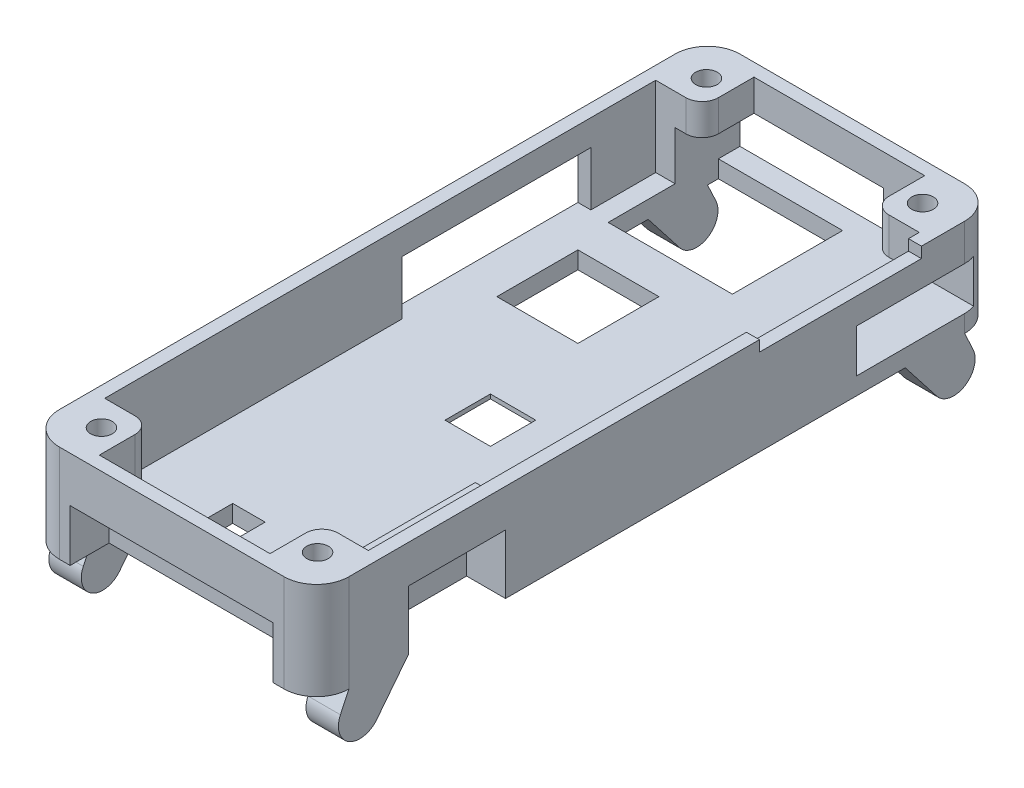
from build123d import *

# Parameters (mm, degrees)
SKETCH_1_W                = 26.8
SKETCH_1_H                = 63
EXTRUDE_1_DEPTH           = 9
FILLET_1_R                = 3
SHELL_1_T                 = -1.2
SHELL_1_THICKNESS_2_DEPTH = 0.4
EXTRUDE_START             = 7.4
EXTRUDE_2_DEPTH           = 7.4
MIRROR_START              = 7.4
MIRROR_2_COPY_1_DEPTH     = 7.4
SKETCH_4_W                = 18.8
SKETCH_4_H                = 3.6
CUT_EXTRUDE_1_DEPTH       = 4.8
SKETCH_5_W                = 3
SKETCH_5_H                = 4.5
SKETCH_5_W_2              = 4.2
SKETCH_5_H_2              = 4.2
CUT_EXTRUDE_2_DEPTH       = 36.02242139
SKETCH_7_W                = 11.5
SKETCH_7_H                = 11
SKETCH_7_W_2              = 7.5
SKETCH_7_H_2              = 7.5
CUT_EXTRUDE_3_DEPTH       = 1.6
SKETCH_8_W                = 4
SKETCH_8_H                = 9
CUT_EXTRUDE_4_DEPTH       = 5.5
EXTRUDE_4_DEPTH           = 3
MIRROR_4_COPY_1_DEPTH     = 3
SKETCH_10_W               = 9
SKETCH_10_H               = 1.2
EXTRUDE_5_DEPTH           = 2.8
CUT_EXTRUDE_7_REACH       = 38.798
SKETCH_11_W               = 1
SKETCH_11_H               = 6
SKETCH_12_W               = 2.8
SKETCH_12_H               = 5.1
EXTRUDE_6_DEPTH           = 1.2
SKETCH_13_W               = 2.8
SKETCH_13_H               = 5.1
EXTRUDE_7_DEPTH           = 1.2
SKETCH_14_W               = 1.5
SKETCH_14_H               = 3.8
EXTRUDE_11_DEPTH          = 4.2
EXTRUDE_12_DEPTH          = 1
MIRROR_9_COPY_1_DEPTH     = 1
SKETCH_3_R                = 1
CUT_EXTRUDE_8_DEPTH       = 4
MIRROR_11_COPY_1_SKETCH_R = 1
MIRROR_11_COPY_1_DEPTH    = 4
FILLET_2_R                = 1.5
CUT_EXTRUDE_9_REACH       = 44.326
SKETCH_18_W               = 11
SKETCH_18_H               = 4
CUT_EXTRUDE_START         = -4.8
SKETCH_19_W               = 10.5
SKETCH_19_H               = 1.2
CUT_EXTRUDE_10_DEPTH      = 4.8
SKETCH_20_W               = 0.4
SKETCH_20_H               = 9
EXTRUDE_13_DEPTH          = 5.5
SKETCH_21_W               = 14.5
SKETCH_21_H               = 4.5
CUT_EXTRUDE_12_DEPTH      = 10
SKETCH_23_R               = 10.3
CUT_EXTRUDE_15_DEPTH      = 1.2
SKETCH_24_W               = 11.5
SKETCH_24_H               = 2
EXTRUDE_14_DEPTH          = 1.6
SKETCH_25_W               = 1.2
SKETCH_25_H               = 15
CUT_EXTRUDE_16_DEPTH      = 1
SKETCH_26_W               = 17.5
SKETCH_26_H               = 5
CUT_EXTRUDE_17_DEPTH      = 1.2


with BuildPart() as part:
    # Sketch 1 → Extrude 1 (new body)
    with BuildSketch(Plane(origin=(0, 0, 0), x_dir=(1, 0, 0), z_dir=(0, 1, 0))):
        Rectangle(SKETCH_1_W, SKETCH_1_H)
    extrude(amount=EXTRUDE_1_DEPTH)

    # Fillet 1
    fillet_1_edges = [part.edges().sort_by_distance(p)[0] for p in [
        (13.4, 4.5, 31.5),
        (-13.4, 4.5, 31.5),
        (-13.4, 4.5, -31.5),
        (13.4, 4.5, -31.5),
    ]]
    fillet(fillet_1_edges, radius=FILLET_1_R)

    # Shell 1
    shell_1_openings = [part.faces().sort_by_distance(p)[0] for p in [
        (0, 9, 0),
    ]]
    offset(amount=SHELL_1_T, openings=shell_1_openings, kind=Kind.INTERSECTION)

    # Shell 1 thickness 2 face (on inner face of the shell) → Shell 1 thickness 2 (add)
    with BuildSketch(Plane(origin=(0, 1.2, 0), x_dir=(0, 0, -1), z_dir=(0, -1, 0))):
        with BuildLine():
            ThreePointArc((30.3, -10.4), (29.772792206, -11.672792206), (28.5, -12.2))
            Line((28.5, -12.2), (-28.5, -12.2))
            ThreePointArc((-28.5, -12.2), (-29.772792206, -11.672792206), (-30.3, -10.4))
            Line((-30.3, -10.4), (-30.3, 10.4))
            ThreePointArc((-30.3, 10.4), (-29.772792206, 11.672792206), (-28.5, 12.2))
            Line((-28.5, 12.2), (28.5, 12.2))
            ThreePointArc((28.5, 12.2), (29.772792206, 11.672792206), (30.3, 10.4))
            Line((30.3, 10.4), (30.3, -10.4))
        make_face()
    extrude(amount=-SHELL_1_THICKNESS_2_DEPTH)

    # Sketch 2 → Extrude 2 (add)
    with BuildSketch(Plane(origin=(0, 1.6, 0), x_dir=(1, 0, 0), z_dir=(0, 1, 0)).offset(EXTRUDE_START)):
        with BuildLine():
            Line((10, -26.5), (9.4, -26.5))
            Line((9.4, -26.5), (9.4, -26.625227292))
            Line((9.4, -26.625227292), (9.4, -30.3))
            Line((9.4, -30.3), (10.4, -30.3))
            ThreePointArc((10.4, -30.3), (11.672792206, -29.772792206), (12.2, -28.5))
            Line((12.2, -28.5), (12.2, -26.5))
            Line((12.2, -26.5), (10, -26.5))
        make_face()
    extrude_2 = extrude(amount=-EXTRUDE_2_DEPTH)

    # Mirror 1: Extrude 2 across plane
    add(extrude_2.mirror(Plane(origin=(0, 0, 0), x_dir=(0, 0, 1), z_dir=(1, 0, 0))))

    # Mirror 2: Extrude 2 across plane
    add(extrude_2.mirror(Plane.XY))

    # Mirror 2 copy 1 sketch → Mirror 2 copy 1 (add)
    with BuildSketch(Plane(origin=(0, 1.6, 0), x_dir=(-1, 0, 0), z_dir=(0, 1, 0)).offset(MIRROR_START)):
        with BuildLine():
            Line((10, -26.5), (9.4, -26.5))
            Line((9.4, -26.5), (9.4, -26.625227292))
            Line((9.4, -26.625227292), (9.4, -30.3))
            Line((9.4, -30.3), (10.4, -30.3))
            ThreePointArc((10.4, -30.3), (11.672792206, -29.772792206), (12.2, -28.5))
            Line((12.2, -28.5), (12.2, -26.5))
            Line((12.2, -26.5), (10, -26.5))
        make_face()
    extrude(amount=-MIRROR_2_COPY_1_DEPTH)

    # Sketch 4 → Cut-Extrude 1 (cut)
    with BuildSketch(Plane.XZ):
        with Locations((0, 29.7)):
            Rectangle(SKETCH_4_W, SKETCH_4_H)
    extrude(amount=-CUT_EXTRUDE_1_DEPTH, mode=Mode.SUBTRACT)

    # Sketch 5 → Cut-Extrude 2 (cut, through all)
    with BuildSketch(Plane(origin=(0, 1.6, 0), x_dir=(1, 0, 0), z_dir=(0, 1, 0))):
        with Locations((-3.75, -22.85)):
            Rectangle(SKETCH_5_W, SKETCH_5_H)
        with Locations((4.75, -22.85)):
            Rectangle(SKETCH_5_W, SKETCH_5_H)
        with Locations((0, -2)):
            Rectangle(SKETCH_5_W_2, SKETCH_5_H_2)
    extrude(amount=-CUT_EXTRUDE_2_DEPTH, mode=Mode.SUBTRACT)

    # Sketch 7 → Cut-Extrude 3 (cut)
    with BuildSketch(Plane.XZ):
        with Locations((-4.65, -24.8)):
            Rectangle(SKETCH_7_W, SKETCH_7_H)
        with Locations((-5.85, -11.95)):
            Rectangle(SKETCH_7_W_2, SKETCH_7_H_2)
    extrude(amount=-CUT_EXTRUDE_3_DEPTH, mode=Mode.SUBTRACT)

    # Sketch 8 → Cut-Extrude 4 (cut)
    with BuildSketch(Plane.XZ):
        with Locations((11.4, 18.5)):
            Rectangle(SKETCH_8_W, SKETCH_8_H)
    extrude(amount=-CUT_EXTRUDE_4_DEPTH, mode=Mode.SUBTRACT)

    # Sketch 9 → Extrude 4 (add)
    with BuildSketch(Plane.ZY.offset(13.4)):
        with BuildLine():
            Line((-28.5, 0), (-29.282023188, -1.677054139))
            ThreePointArc((-29.282023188, -1.677054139), (-28.520418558, -4.207589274), (-25.919933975, -3.737345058))
            Line((-25.919933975, -3.737345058), (-23, 0))
            Line((-23, 0), (-28.5, 0))
        make_face()
    extrude_4 = extrude(amount=-EXTRUDE_4_DEPTH)

    # Mirror 3: Extrude 4 across plane
    add(extrude_4.mirror(Plane.XY))

    # Mirror 4: Extrude 4 across plane
    add(extrude_4.mirror(Plane(origin=(0, 0, 0), x_dir=(0, 0, 1), z_dir=(1, 0, 0))))

    # Mirror 4 copy 1 sketch → Mirror 4 copy 1 (add)
    with BuildSketch(Plane(origin=(13.4, 0, 0), x_dir=(0, 0, -1), z_dir=(1, 0, 0))):
        with BuildLine():
            Line((-28.5, 0), (-29.282023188, -1.677054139))
            ThreePointArc((-29.282023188, -1.677054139), (-28.520418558, -4.207589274), (-25.919933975, -3.737345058))
            Line((-25.919933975, -3.737345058), (-23, 0))
            Line((-23, 0), (-28.5, 0))
        make_face()
    extrude(amount=-MIRROR_4_COPY_1_DEPTH)

    # Sketch 10 → Extrude 5 (add)
    with BuildSketch(Plane.ZY.offset(-12.2)):
        with Locations((18.5, 6.1)):
            Rectangle(SKETCH_10_W, SKETCH_10_H)
    extrude(amount=EXTRUDE_5_DEPTH)

    # Sketch 11 → Cut-Extrude 7 (cut, up to next)
    with BuildSketch(Plane(origin=(0, 9, 0), x_dir=(1, 0, 0), z_dir=(0, 1, 0)), mode=Mode.PRIVATE) as cut_extrude_7_sk1:
        with Locations((11.7, -18.5)):
            Rectangle(SKETCH_11_W, SKETCH_11_H)
    cut_extrude_7_tool1 = extrude(cut_extrude_7_sk1.sketch, amount=-CUT_EXTRUDE_7_REACH, mode=Mode.PRIVATE) & part.part
    add(cut_extrude_7_tool1.solids().sort_by_distance((11.7, 9, 18.5))[0], mode=Mode.SUBTRACT)

    # Sketch 12 → Extrude 6 (add)
    with BuildSketch(Plane(origin=(0, 0, 14), x_dir=(-1, 0, 0), z_dir=(0, 0, -1))):
        with Locations((-10.8, 4.15)):
            Rectangle(SKETCH_12_W, SKETCH_12_H)
    extrude(amount=EXTRUDE_6_DEPTH)

    # Sketch 13 → Extrude 7 (add)
    with BuildSketch(Plane.XY.offset(23)):
        with Locations((10.8, 4.15)):
            Rectangle(SKETCH_13_W, SKETCH_13_H)
    extrude(amount=EXTRUDE_7_DEPTH)

    # Sketch 14 → Extrude 11 (add)
    with BuildSketch(Plane.XZ.offset(-4.8)):
        with Locations((-8.65, 28.4)):
            Rectangle(SKETCH_14_W, SKETCH_14_H)
        with Locations((8.65, 28.4)):
            Rectangle(SKETCH_14_W, SKETCH_14_H)
    extrude_11 = extrude(amount=-EXTRUDE_11_DEPTH)

    # Mirror 7: Extrude 11 across plane
    add(extrude_11.mirror(Plane.XY))

    # Sketch 16 → Extrude 12 (add)
    with BuildSketch(Plane(origin=(0, 0, 26.5), x_dir=(-1, 0, 0), z_dir=(0, 0, -1))):
        Polygon((12.2, 1.6), (9.4, 1.6), (9.4, 4.8), (7.9, 4.8), (7.9, 9), (12.2, 9), align=None)
    extrude_12 = extrude(amount=EXTRUDE_12_DEPTH)

    # Mirror 8: Extrude 12 across plane
    add(extrude_12.mirror(Plane(origin=(0, 0, 0), x_dir=(0, 0, 1), z_dir=(1, 0, 0))))

    # Mirror 9: Extrude 12 across plane
    add(extrude_12.mirror(Plane.XY))

    # Mirror 9 copy 1 sketch → Mirror 9 copy 1 (add)
    with BuildSketch(Plane.XY.offset(-26.5)):
        Polygon((12.2, 1.6), (9.4, 1.6), (9.4, 4.8), (7.9, 4.8), (7.9, 9), (12.2, 9), align=None)
    extrude(amount=MIRROR_9_COPY_1_DEPTH)

    # Sketch 3 → Cut-Extrude 8 (cut)
    with BuildSketch(Plane(origin=(0, 9, 0), x_dir=(1, 0, 0), z_dir=(0, 1, 0))):
        with Locations(Location((10, -28, 0), (0, 0, 270))):
            Circle(SKETCH_3_R)
    cut_extrude_8 = extrude(amount=-CUT_EXTRUDE_8_DEPTH, mode=Mode.SUBTRACT)

    # Mirror 10: Cut-Extrude 8 across plane
    add(cut_extrude_8.mirror(Plane(origin=(0, 0, 0), x_dir=(0, 0, 1), z_dir=(1, 0, 0))), mode=Mode.SUBTRACT)

    # Mirror 11: Cut-Extrude 8 across plane
    add(cut_extrude_8.mirror(Plane.XY), mode=Mode.SUBTRACT)

    # Mirror 11 copy 1 sketch → Mirror 11 copy 1 (cut)
    with BuildSketch(Plane(origin=(0, 9, 0), x_dir=(-1, 0, 0), z_dir=(0, 1, 0))):
        with Locations(Location((10, -28, 0), (0, 0, 270))):
            Circle(MIRROR_11_COPY_1_SKETCH_R)
    extrude(amount=-MIRROR_11_COPY_1_DEPTH, mode=Mode.SUBTRACT)

    # Fillet 2
    fillet_2_edges = [part.edges().sort_by_distance(p)[0] for p in [
        (-7.9, 6.9, 25.5),
        (7.9, 6.9, 25.5),
        (7.9, 6.9, -25.5),
        (-7.9, 6.9, -25.5),
    ]]
    fillet(fillet_2_edges, radius=FILLET_2_R)

    # Sketch 18 → Cut-Extrude 9 (cut, up to next)
    with BuildSketch(Plane(origin=(13.4, 0, 0), x_dir=(0, 0, -1), z_dir=(1, 0, 0)), mode=Mode.PRIVATE) as cut_extrude_9_sk1:
        with Locations((24, 3.6)):
            Rectangle(SKETCH_18_W, SKETCH_18_H)
    cut_extrude_9_tool1 = extrude(cut_extrude_9_sk1.sketch, amount=-CUT_EXTRUDE_9_REACH, mode=Mode.PRIVATE) & part.part
    add(cut_extrude_9_tool1.solids().sort_by_distance((13.4, 3.6, -24))[0], mode=Mode.SUBTRACT)

    # Sketch 19 → Cut-Extrude 10 (cut)
    with BuildSketch(Plane.XZ.offset(CUT_EXTRUDE_START)):
        with Locations((-4.15, -30.9)):
            Rectangle(SKETCH_19_W, SKETCH_19_H)
    extrude(amount=CUT_EXTRUDE_10_DEPTH, mode=Mode.SUBTRACT)

    # Sketch 20 → Extrude 13 (add)
    with BuildSketch(Plane.XZ):
        with Locations((9.6, 18.5)):
            Rectangle(SKETCH_20_W, SKETCH_20_H)
    extrude(amount=-EXTRUDE_13_DEPTH)

    # Sketch 21 → Cut-Extrude 12 (cut)
    with BuildSketch(Plane(origin=(0, 0, -31.5), x_dir=(-1, 0, 0), z_dir=(0, 0, -1))):
        with Locations((3.15, 3.85)):
            Rectangle(SKETCH_21_W, SKETCH_21_H)
    extrude(amount=-CUT_EXTRUDE_12_DEPTH, mode=Mode.SUBTRACT)

    # Sketch 23 → Cut-Extrude 15 (cut)
    with BuildSketch(Plane.XZ):
        with Locations(Location((0, 2, 0), (0, 0, 270))):
            Circle(SKETCH_23_R)
    extrude(amount=-CUT_EXTRUDE_15_DEPTH, mode=Mode.SUBTRACT)

    # Sketch 24 → Extrude 14 (add)
    with BuildSketch(Plane.XZ):
        with Locations((-4.65, -30.5)):
            Rectangle(SKETCH_24_W, SKETCH_24_H)
    extrude(amount=-EXTRUDE_14_DEPTH)

    # Sketch 25 → Cut-Extrude 16 (cut)
    with BuildSketch(Plane(origin=(0, 9, 0), x_dir=(1, 0, 0), z_dir=(0, 1, 0))):
        with Locations((12.8, 17)):
            Rectangle(SKETCH_25_W, SKETCH_25_H)
    extrude(amount=-CUT_EXTRUDE_16_DEPTH, mode=Mode.SUBTRACT)

    # Sketch 26 → Cut-Extrude 17 (cut)
    with BuildSketch(Plane.ZY.offset(13.4)):
        with Locations((-10.75, 4.1)):
            Rectangle(SKETCH_26_W, SKETCH_26_H)
    extrude(amount=-CUT_EXTRUDE_17_DEPTH, mode=Mode.SUBTRACT)


solid = part.part
